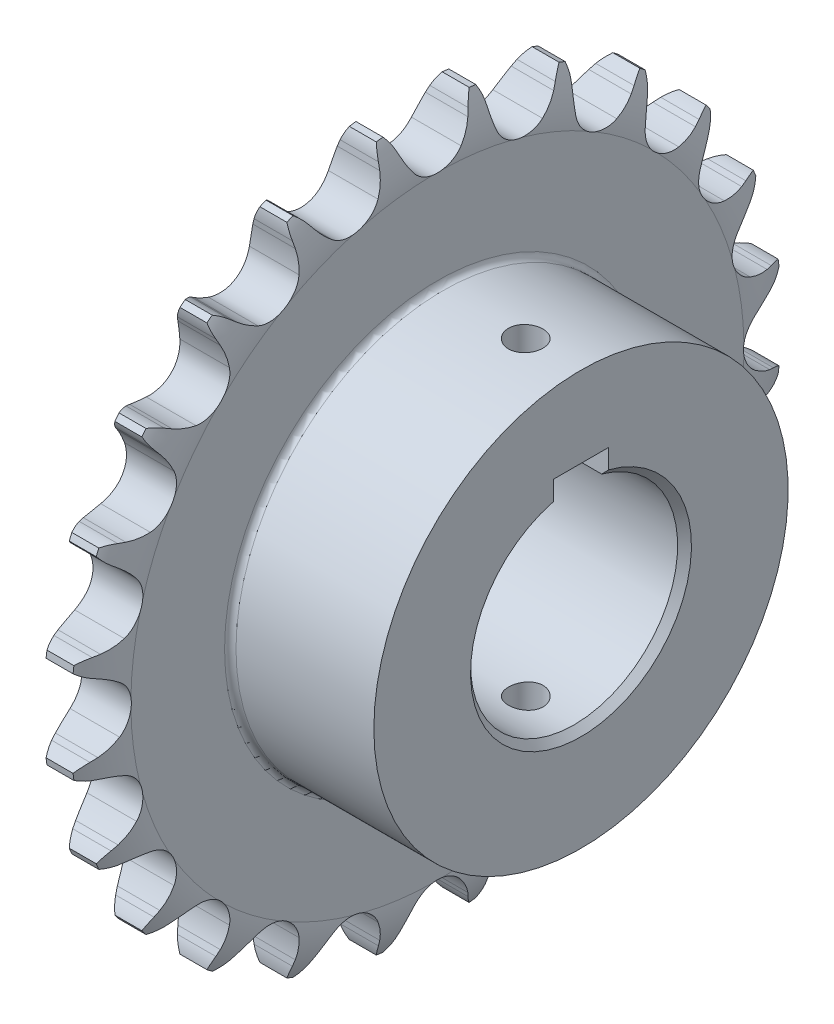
from build123d import *

# Parameters (mm, degrees)
CUT_EXTRUDE_1_DEPTH      = 4.638656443
PATTERN_CIRCULAR_1_COUNT = 24
CHAMFER_2_SIZE           = 1
SKETCH_3_W               = 8
SKETCH_3_H               = 14.508103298
CUT_EXTRUDE_2_DEPTH      = 78.528302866
HOLE_WIZARD_M6_1_D       = 5


with BuildPart() as part:
    # Sketch 1 → Revolve 1 (revolve)
    with BuildSketch(Plane.XY, mode=Mode.PRIVATE) as revolve_1_sk:
        with BuildLine():
            Line((-3.60375, 15), (-3.60375, 44.394239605))
            ThreePointArc((-3.60375, 44.394239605), (-3.299433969, 48.068215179), (-1.95275, 51.5))
            Line((-1.95275, 51.5), (1.95275, 51.5))
            ThreePointArc((1.95275, 51.5), (3.299433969, 48.068215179), (3.60375, 44.394239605))
            Line((3.60375, 44.394239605), (3.60375, 30.827925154))
            ThreePointArc((3.60375, 30.827925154), (3.846243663, 30.242493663), (4.431675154, 30))
            Line((4.431675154, 30), (24.39625, 30))
            Line((24.39625, 30), (24.39625, 15))
            Line((24.39625, 15), (-3.60375, 15))
        make_face()
    revolve(revolve_1_sk.sketch.rotate(Axis((-6.35, 0, 0), (1, 0, 0)), 90), axis=Axis((-6.35, 0, 0), (1, 0, 0)))

    # Sketch 2 → Cut-Extrude 1 (cut, symmetric)
    with BuildSketch(Plane(origin=(0, 0, 0), x_dir=(0, 0, -1), z_dir=(1, 0, 0))):
        with BuildLine():
            Line((4.934459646, 48.652762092), (5.269307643, 49.488531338))
            ThreePointArc((5.269307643, 49.488531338), (5.690920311, 50.342312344), (6.239482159, 51.120630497))
            ThreePointArc((6.239482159, 51.120630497), (0, 51.5), (-6.239482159, 51.120630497))
            ThreePointArc((-6.239482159, 51.120630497), (-5.690920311, 50.342312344), (-5.269307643, 49.488531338))
            Line((-5.269307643, 49.488531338), (-4.934459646, 48.652762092))
            ThreePointArc((-4.934459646, 48.652762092), (-4.27364039, 47.28274198), (-3.432264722, 46.015570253))
            ThreePointArc((-3.432264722, 46.015570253), (0, 44.322964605), (3.432264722, 46.015570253))
            ThreePointArc((3.432264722, 46.015570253), (4.27364039, 47.28274198), (4.934459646, 48.652762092))
        make_face()
    cut_extrude_1 = extrude(amount=CUT_EXTRUDE_1_DEPTH, both=True, mode=Mode.SUBTRACT)

    # Pattern Circular 1: Cut-Extrude 1 ×24 about axis
    pattern_circular_1_axis = Axis((0, 0, 0), (1, 0, 0))
    for i in range(1, PATTERN_CIRCULAR_1_COUNT):
        add(cut_extrude_1.rotate(pattern_circular_1_axis, i * 360 / PATTERN_CIRCULAR_1_COUNT), mode=Mode.SUBTRACT)

    # Chamfer 2
    chamfer_2_edges = [part.edges().sort_by_distance(p)[0] for p in [
        (24.39625, 0, -15),
        (-3.60375, 0, -15),
    ]]
    chamfer(chamfer_2_edges, length=CHAMFER_2_SIZE)

    # Sketch 3 → Cut-Extrude 2 (cut, through all)
    with BuildSketch(Plane.ZY.offset(3.60375)):
        with Locations((0, 11.045948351)):
            Rectangle(SKETCH_3_W, SKETCH_3_H)
    extrude(amount=-CUT_EXTRUDE_2_DEPTH, mode=Mode.SUBTRACT)

    # Hole Wizard M6 _1 (through all)
    with Locations(Plane(origin=(0, 30, 0), x_dir=(1, 0, 0), z_dir=(0, 1, 0))):
        with Locations((16.39625, 0)):
            Hole(HOLE_WIZARD_M6_1_D / 2)


solid = part.part
